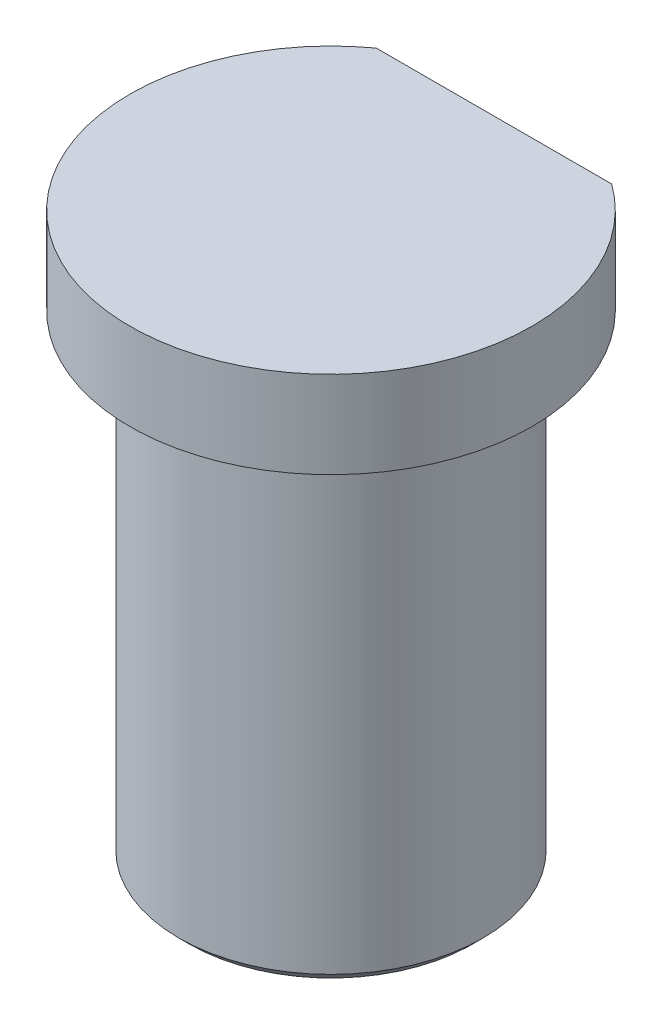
ISO-10303-21;
HEADER;
FILE_DESCRIPTION(('STEP AP214'),'2;1');
FILE_NAME('part.step','',(''),(''),'','','');
FILE_SCHEMA(('AUTOMOTIVE_DESIGN { 1 0 10303 214 1 1 1 1 }'));
ENDSEC;
DATA;
#1=APPLICATION_CONTEXT('core data for automotive mechanical design processes');
#2=APPLICATION_PROTOCOL_DEFINITION('international standard','automotive_design',2000,#1);
#3=PRODUCT_CONTEXT('',#1,'mechanical');
#4=PRODUCT('Part','Part','',(#3));
#5=PRODUCT_RELATED_PRODUCT_CATEGORY('part','',(#4));
#6=PRODUCT_DEFINITION_FORMATION('','',#4);
#7=PRODUCT_DEFINITION_CONTEXT('part definition',#1,'design');
#8=PRODUCT_DEFINITION('design','',#6,#7);
#9=PRODUCT_DEFINITION_SHAPE('','',#8);
#10=(LENGTH_UNIT() NAMED_UNIT(*) SI_UNIT(.MILLI.,.METRE.));
#11=(NAMED_UNIT(*) PLANE_ANGLE_UNIT() SI_UNIT($,.RADIAN.));
#12=(NAMED_UNIT(*) SI_UNIT($,.STERADIAN.) SOLID_ANGLE_UNIT());
#13=UNCERTAINTY_MEASURE_WITH_UNIT(LENGTH_MEASURE(1.E-05),#10,'distance_accuracy_value','');
#14=(GEOMETRIC_REPRESENTATION_CONTEXT(3) GLOBAL_UNCERTAINTY_ASSIGNED_CONTEXT((#13)) GLOBAL_UNIT_ASSIGNED_CONTEXT((#10,
#11,#12)) REPRESENTATION_CONTEXT('',''));
#15=CARTESIAN_POINT('',(0.,0.,0.));
#16=DIRECTION('',(0.,0.,1.));
#17=DIRECTION('',(1.,0.,0.));
#18=AXIS2_PLACEMENT_3D('',#15,#16,#17);
#19=CARTESIAN_POINT('',(0.,-113.958548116,65.));
#20=DIRECTION('',(0.,-1.,0.));
#21=DIRECTION('',(0.,0.,-1.));
#22=AXIS2_PLACEMENT_3D('',#19,#20,#21);
#23=CONICAL_SURFACE('',#22,0.,1.04719755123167);
#24=CARTESIAN_POINT('',(0.,-113.958548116,65.));
#25=VERTEX_POINT('',#24);
#26=VERTEX_LOOP('',#25);
#27=FACE_BOUND('',#26,.T.);
#28=CARTESIAN_POINT('',(0.,-118.,65.));
#29=DIRECTION('',(0.,-1.,0.));
#30=DIRECTION('',(-1.,0.,0.));
#31=AXIS2_PLACEMENT_3D('',#28,#29,#30);
#32=CIRCLE('',#31,7.);
#33=CARTESIAN_POINT('',(-7.,-118.,65.));
#34=VERTEX_POINT('',#33);
#35=EDGE_CURVE('E70',#34,#34,#32,.F.);
#36=ORIENTED_EDGE('',*,*,#35,.F.);
#37=EDGE_LOOP('',(#36));
#38=FACE_BOUND('',#37,.T.);
#39=ADVANCED_FACE('F16',(#27,#38),#23,.F.);
#40=CARTESIAN_POINT('',(0.,-118.,65.));
#41=DIRECTION('',(0.,-1.,0.));
#42=DIRECTION('',(0.,0.,-1.));
#43=AXIS2_PLACEMENT_3D('',#40,#41,#42);
#44=CYLINDRICAL_SURFACE('',#43,7.);
#45=ORIENTED_EDGE('',*,*,#35,.T.);
#46=EDGE_LOOP('',(#45));
#47=FACE_BOUND('',#46,.T.);
#48=CARTESIAN_POINT('',(0.,-158.,65.));
#49=DIRECTION('',(0.,-1.,0.));
#50=DIRECTION('',(0.,0.,-1.));
#51=AXIS2_PLACEMENT_3D('',#48,#49,#50);
#52=CIRCLE('',#51,7.);
#53=CARTESIAN_POINT('',(0.,-158.,58.));
#54=VERTEX_POINT('',#53);
#55=EDGE_CURVE('E20',#54,#54,#52,.F.);
#56=ORIENTED_EDGE('',*,*,#55,.F.);
#57=EDGE_LOOP('',(#56));
#58=FACE_BOUND('',#57,.T.);
#59=ADVANCED_FACE('F66',(#47,#58),#44,.F.);
#60=CARTESIAN_POINT('',(-13.156,-158.,51.844));
#61=DIRECTION('',(0.,-1.,0.));
#62=DIRECTION('',(1.,0.,0.));
#63=AXIS2_PLACEMENT_3D('',#60,#61,#62);
#64=PLANE('',#63);
#65=ORIENTED_EDGE('',*,*,#55,.T.);
#66=EDGE_LOOP('',(#65));
#67=FACE_BOUND('',#66,.T.);
#68=CARTESIAN_POINT('',(0.,-158.,65.));
#69=DIRECTION('',(0.,1.,0.));
#70=DIRECTION('',(0.,0.,1.));
#71=AXIS2_PLACEMENT_3D('',#68,#69,#70);
#72=CIRCLE('',#71,13.);
#73=CARTESIAN_POINT('',(0.,-158.,78.));
#74=VERTEX_POINT('',#73);
#75=EDGE_CURVE('E74',#74,#74,#72,.F.);
#76=ORIENTED_EDGE('',*,*,#75,.T.);
#77=EDGE_LOOP('',(#76));
#78=FACE_BOUND('',#77,.T.);
#79=ADVANCED_FACE('F203',(#67,#78),#64,.T.);
#80=CARTESIAN_POINT('',(0.,-158.,65.));
#81=DIRECTION('',(0.,1.,0.));
#82=DIRECTION('',(0.,0.,1.));
#83=AXIS2_PLACEMENT_3D('',#80,#81,#82);
#84=CONICAL_SURFACE('',#83,13.,0.785398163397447);
#85=ORIENTED_EDGE('',*,*,#75,.F.);
#86=EDGE_LOOP('',(#85));
#87=FACE_BOUND('',#86,.T.);
#88=CARTESIAN_POINT('',(0.,-157.,65.));
#89=DIRECTION('',(0.,-1.,0.));
#90=DIRECTION('',(-1.,0.,0.));
#91=AXIS2_PLACEMENT_3D('',#88,#89,#90);
#92=CIRCLE('',#91,14.);
#93=CARTESIAN_POINT('',(-14.,-157.,65.));
#94=VERTEX_POINT('',#93);
#95=EDGE_CURVE('E77',#94,#94,#92,.T.);
#96=ORIENTED_EDGE('',*,*,#95,.T.);
#97=EDGE_LOOP('',(#96));
#98=FACE_BOUND('',#97,.T.);
#99=ADVANCED_FACE('F199',(#87,#98),#84,.T.);
#100=CARTESIAN_POINT('',(0.,-114.5,65.));
#101=DIRECTION('',(0.,-1.,0.));
#102=DIRECTION('',(0.,0.,-1.));
#103=AXIS2_PLACEMENT_3D('',#100,#101,#102);
#104=CYLINDRICAL_SURFACE('',#103,14.);
#105=ORIENTED_EDGE('',*,*,#95,.F.);
#106=EDGE_LOOP('',(#105));
#107=FACE_BOUND('',#106,.T.);
#108=CARTESIAN_POINT('',(0.,-114.499999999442,65.));
#109=DIRECTION('',(0.,-1.,0.));
#110=DIRECTION('',(0.,0.,-1.));
#111=AXIS2_PLACEMENT_3D('',#108,#109,#110);
#112=CIRCLE('',#111,13.9999999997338);
#113=CARTESIAN_POINT('',(-13.9999999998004,-114.499999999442,65.));
#114=VERTEX_POINT('',#113);
#115=CARTESIAN_POINT('',(13.9999999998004,-114.499999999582,65.0000000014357));
#116=VERTEX_POINT('',#115);
#117=EDGE_CURVE('E120',#114,#116,#112,.T.);
#118=ORIENTED_EDGE('',*,*,#117,.T.);
#119=CARTESIAN_POINT('',(0.,-114.499999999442,65.));
#120=DIRECTION('',(0.,-1.,0.));
#121=DIRECTION('',(0.,0.,-1.));
#122=AXIS2_PLACEMENT_3D('',#119,#120,#121);
#123=CIRCLE('',#122,13.9999999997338);
#124=EDGE_CURVE('E113',#116,#114,#123,.T.);
#125=ORIENTED_EDGE('',*,*,#124,.T.);
#126=EDGE_LOOP('',(#118,#125));
#127=FACE_BOUND('',#126,.T.);
#128=ADVANCED_FACE('F191',(#107,#127),#104,.T.);
#129=CARTESIAN_POINT('',(14.549916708,-114.002497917,65.));
#130=CARTESIAN_POINT('',(14.549916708,-114.002497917,94.099833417));
#131=CARTESIAN_POINT('',(-14.549916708,-114.002497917,94.099833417));
#132=CARTESIAN_POINT('',(-14.549916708,-114.002497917,65.));
#133=CARTESIAN_POINT('',(14.209973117,-113.968389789,65.));
#134=CARTESIAN_POINT('',(14.209973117,-113.968389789,93.419946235));
#135=CARTESIAN_POINT('',(-14.209973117,-113.968389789,93.419946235));
#136=CARTESIAN_POINT('',(-14.209973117,-113.968389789,65.));
#137=CARTESIAN_POINT('',(13.968389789,-114.209973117,65.));
#138=CARTESIAN_POINT('',(13.968389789,-114.209973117,92.936779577));
#139=CARTESIAN_POINT('',(-13.968389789,-114.209973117,92.936779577));
#140=CARTESIAN_POINT('',(-13.968389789,-114.209973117,65.));
#141=CARTESIAN_POINT('',(14.002497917,-114.549916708,65.));
#142=CARTESIAN_POINT('',(14.002497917,-114.549916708,93.004995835));
#143=CARTESIAN_POINT('',(-14.002497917,-114.549916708,93.004995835));
#144=CARTESIAN_POINT('',(-14.002497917,-114.549916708,65.));
#145=(BOUNDED_SURFACE() B_SPLINE_SURFACE(3,3,((#129,#130,#131,#132),(#133,#134,#135,#136),(#137,
#138,#139,#140),(#141,#142,#143,#144)),.UNSPECIFIED.,.F.,.F.,
.F.) B_SPLINE_SURFACE_WITH_KNOTS((4,4),(4,4),(0.,1.),(0.,1.),
.UNSPECIFIED.) GEOMETRIC_REPRESENTATION_ITEM() RATIONAL_B_SPLINE_SURFACE(((1.,0.333333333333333,
0.333333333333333,1.),(0.755320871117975,0.251773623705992,0.251773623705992,0.755320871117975),
(0.755320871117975,0.251773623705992,0.251773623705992,0.755320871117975),(1.,0.333333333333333,
0.333333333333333,1.))) REPRESENTATION_ITEM('') SURFACE());
#146=CARTESIAN_POINT('',(14.549916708,-114.002497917,65.));
#147=CARTESIAN_POINT('',(14.209973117,-113.968389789,65.));
#148=CARTESIAN_POINT('',(13.968389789,-114.209973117,65.));
#149=CARTESIAN_POINT('',(14.002497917,-114.549916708,65.));
#150=(BOUNDED_CURVE() B_SPLINE_CURVE(3,(#146,#147,#148,#149),.UNSPECIFIED.,.F.,
.F.) B_SPLINE_CURVE_WITH_KNOTS((4,4),(0.,1.),
.UNSPECIFIED.) CURVE() GEOMETRIC_REPRESENTATION_ITEM() RATIONAL_B_SPLINE_CURVE((1.,
0.755320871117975,0.755320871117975,1.)) REPRESENTATION_ITEM(''));
#151=CARTESIAN_POINT('',(14.4999999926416,-113.99999999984,64.99999999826));
#152=VERTEX_POINT('',#151);
#153=EDGE_CURVE('E52',#116,#152,#150,.F.);
#154=CARTESIAN_POINT('',(14.4999999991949,-113.999999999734,65.));
#155=CARTESIAN_POINT('',(14.4999999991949,-113.999999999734,93.9999999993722));
#156=CARTESIAN_POINT('',(-14.4999999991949,-113.999999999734,93.9999999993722));
#157=CARTESIAN_POINT('',(-14.4999999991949,-113.999999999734,65.));
#158=(BOUNDED_CURVE() B_SPLINE_CURVE(3,(#154,#155,#156,#157),.UNSPECIFIED.,.F.,
.F.) B_SPLINE_CURVE_WITH_KNOTS((4,4),(0.,1.),
.UNSPECIFIED.) CURVE() GEOMETRIC_REPRESENTATION_ITEM() RATIONAL_B_SPLINE_CURVE((0.956578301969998,
0.318859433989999,0.318859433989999,0.956578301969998)) REPRESENTATION_ITEM(''));
#159=CARTESIAN_POINT('',(-14.4999999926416,-113.99999999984,64.99999999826));
#160=VERTEX_POINT('',#159);
#161=EDGE_CURVE('E83',#160,#152,#158,.F.);
#162=CARTESIAN_POINT('',(-14.549916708,-114.002497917,65.));
#163=CARTESIAN_POINT('',(-14.209973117,-113.968389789,65.));
#164=CARTESIAN_POINT('',(-13.968389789,-114.209973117,65.));
#165=CARTESIAN_POINT('',(-14.002497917,-114.549916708,65.));
#166=(BOUNDED_CURVE() B_SPLINE_CURVE(3,(#162,#163,#164,#165),.UNSPECIFIED.,.F.,
.F.) B_SPLINE_CURVE_WITH_KNOTS((4,4),(0.,1.),
.UNSPECIFIED.) CURVE() GEOMETRIC_REPRESENTATION_ITEM() RATIONAL_B_SPLINE_CURVE((1.,
0.755320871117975,0.755320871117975,1.)) REPRESENTATION_ITEM(''));
#167=EDGE_CURVE('E116',#160,#114,#166,.T.);
#168=ORIENTED_EDGE('',*,*,#153,.T.);
#169=ORIENTED_EDGE('',*,*,#161,.F.);
#170=ORIENTED_EDGE('',*,*,#167,.T.);
#171=ORIENTED_EDGE('',*,*,#124,.F.);
#172=EDGE_LOOP('',(#168,#169,#170,#171));
#173=FACE_BOUND('',#172,.T.);
#174=ADVANCED_FACE('F156',(#173),#145,.F.);
#175=CARTESIAN_POINT('',(-14.549916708,-114.002497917,65.));
#176=CARTESIAN_POINT('',(-14.549916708,-114.002497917,35.900166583));
#177=CARTESIAN_POINT('',(14.549916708,-114.002497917,35.900166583));
#178=CARTESIAN_POINT('',(14.549916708,-114.002497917,65.));
#179=CARTESIAN_POINT('',(-14.209973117,-113.968389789,65.));
#180=CARTESIAN_POINT('',(-14.209973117,-113.968389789,36.580053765));
#181=CARTESIAN_POINT('',(14.209973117,-113.968389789,36.580053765));
#182=CARTESIAN_POINT('',(14.209973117,-113.968389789,65.));
#183=CARTESIAN_POINT('',(-13.968389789,-114.209973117,65.));
#184=CARTESIAN_POINT('',(-13.968389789,-114.209973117,37.063220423));
#185=CARTESIAN_POINT('',(13.968389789,-114.209973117,37.063220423));
#186=CARTESIAN_POINT('',(13.968389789,-114.209973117,65.));
#187=CARTESIAN_POINT('',(-14.002497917,-114.549916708,65.));
#188=CARTESIAN_POINT('',(-14.002497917,-114.549916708,36.995004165));
#189=CARTESIAN_POINT('',(14.002497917,-114.549916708,36.995004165));
#190=CARTESIAN_POINT('',(14.002497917,-114.549916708,65.));
#191=(BOUNDED_SURFACE() B_SPLINE_SURFACE(3,3,((#175,#176,#177,#178),(#179,#180,#181,#182),(#183,
#184,#185,#186),(#187,#188,#189,#190)),.UNSPECIFIED.,.F.,.F.,
.F.) B_SPLINE_SURFACE_WITH_KNOTS((4,4),(4,4),(0.,1.),(0.,1.),
.UNSPECIFIED.) GEOMETRIC_REPRESENTATION_ITEM() RATIONAL_B_SPLINE_SURFACE(((1.,0.333333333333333,
0.333333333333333,1.),(0.755320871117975,0.251773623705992,0.251773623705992,0.755320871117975),
(0.755320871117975,0.251773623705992,0.251773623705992,0.755320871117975),(1.,0.333333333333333,
0.333333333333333,1.))) REPRESENTATION_ITEM('') SURFACE());
#192=CARTESIAN_POINT('',(-14.4999999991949,-113.999999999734,65.));
#193=CARTESIAN_POINT('',(-14.4999999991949,-113.999999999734,36.0000000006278));
#194=CARTESIAN_POINT('',(14.4999999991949,-113.999999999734,36.0000000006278));
#195=CARTESIAN_POINT('',(14.4999999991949,-113.999999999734,65.));
#196=(BOUNDED_CURVE() B_SPLINE_CURVE(3,(#192,#193,#194,#195),.UNSPECIFIED.,.F.,
.F.) B_SPLINE_CURVE_WITH_KNOTS((4,4),(0.,1.),
.UNSPECIFIED.) CURVE() GEOMETRIC_REPRESENTATION_ITEM() RATIONAL_B_SPLINE_CURVE((0.956578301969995,
0.318859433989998,0.318859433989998,0.956578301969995)) REPRESENTATION_ITEM(''));
#197=EDGE_CURVE('E157',#152,#160,#196,.F.);
#198=ORIENTED_EDGE('',*,*,#117,.F.);
#199=ORIENTED_EDGE('',*,*,#167,.F.);
#200=ORIENTED_EDGE('',*,*,#197,.F.);
#201=ORIENTED_EDGE('',*,*,#153,.F.);
#202=EDGE_LOOP('',(#198,#199,#200,#201));
#203=FACE_BOUND('',#202,.T.);
#204=ADVANCED_FACE('F159',(#203),#191,.F.);
#205=CARTESIAN_POINT('',(-10.828203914,-114.,50.));
#206=DIRECTION('',(0.,0.,-1.));
#207=DIRECTION('',(0.,1.,0.));
#208=AXIS2_PLACEMENT_3D('',#205,#206,#207);
#209=PLANE('',#208);
#210=DIRECTION('',(-1.,0.,0.));
#211=VECTOR('',#210,1.);
#212=CARTESIAN_POINT('',(0.,-106.,50.));
#213=LINE('',#212,#211);
#214=CARTESIAN_POINT('',(10.8282039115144,-106.,49.9999999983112));
#215=VERTEX_POINT('',#214);
#216=CARTESIAN_POINT('',(-10.8282039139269,-106.,50.));
#217=VERTEX_POINT('',#216);
#218=EDGE_CURVE('E161',#215,#217,#213,.T.);
#219=ORIENTED_EDGE('',*,*,#218,.F.);
#220=DIRECTION('',(0.,1.,0.));
#221=VECTOR('',#220,1.);
#222=CARTESIAN_POINT('',(10.828203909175,-110.,49.9999999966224));
#223=LINE('',#222,#221);
#224=CARTESIAN_POINT('',(10.8282039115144,-114.,49.9999999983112));
#225=VERTEX_POINT('',#224);
#226=EDGE_CURVE('E35',#215,#225,#223,.F.);
#227=ORIENTED_EDGE('',*,*,#226,.T.);
#228=DIRECTION('',(1.,0.,0.));
#229=VECTOR('',#228,1.);
#230=CARTESIAN_POINT('',(0.,-114.,50.));
#231=LINE('',#230,#229);
#232=CARTESIAN_POINT('',(-10.8282039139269,-114.,50.));
#233=VERTEX_POINT('',#232);
#234=EDGE_CURVE('E134',#233,#225,#231,.T.);
#235=ORIENTED_EDGE('',*,*,#234,.F.);
#236=DIRECTION('',(0.,1.,0.));
#237=VECTOR('',#236,1.);
#238=CARTESIAN_POINT('',(-10.828203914,-110.,50.));
#239=LINE('',#238,#237);
#240=EDGE_CURVE('E132',#233,#217,#239,.T.);
#241=ORIENTED_EDGE('',*,*,#240,.T.);
#242=EDGE_LOOP('',(#219,#227,#235,#241));
#243=FACE_BOUND('',#242,.T.);
#244=ADVANCED_FACE('F97',(#243),#209,.T.);
#245=CARTESIAN_POINT('',(18.722,-114.,83.701));
#246=DIRECTION('',(0.,-1.,0.));
#247=DIRECTION('',(-1.,0.,0.));
#248=AXIS2_PLACEMENT_3D('',#245,#246,#247);
#249=PLANE('',#248);
#250=ORIENTED_EDGE('',*,*,#161,.T.);
#251=ORIENTED_EDGE('',*,*,#197,.T.);
#252=EDGE_LOOP('',(#250,#251));
#253=FACE_BOUND('',#252,.T.);
#254=CARTESIAN_POINT('',(0.,-114.,65.));
#255=DIRECTION('',(0.,-1.,0.));
#256=DIRECTION('',(0.,0.,-1.));
#257=AXIS2_PLACEMENT_3D('',#254,#255,#256);
#258=CIRCLE('',#257,18.5);
#259=EDGE_CURVE('E26',#225,#233,#258,.T.);
#260=ORIENTED_EDGE('',*,*,#259,.T.);
#261=ORIENTED_EDGE('',*,*,#234,.T.);
#262=EDGE_LOOP('',(#260,#261));
#263=FACE_BOUND('',#262,.T.);
#264=ADVANCED_FACE('F88',(#253,#263),#249,.T.);
#265=CARTESIAN_POINT('',(-18.722,-106.,83.701));
#266=DIRECTION('',(0.,1.,0.));
#267=DIRECTION('',(1.,0.,0.));
#268=AXIS2_PLACEMENT_3D('',#265,#266,#267);
#269=PLANE('',#268);
#270=ORIENTED_EDGE('',*,*,#218,.T.);
#271=CARTESIAN_POINT('',(0.,-106.,65.));
#272=DIRECTION('',(0.,-1.,0.));
#273=DIRECTION('',(0.,0.,-1.));
#274=AXIS2_PLACEMENT_3D('',#271,#272,#273);
#275=CIRCLE('',#274,18.5);
#276=EDGE_CURVE('E11',#217,#215,#275,.F.);
#277=ORIENTED_EDGE('',*,*,#276,.T.);
#278=EDGE_LOOP('',(#270,#277));
#279=FACE_BOUND('',#278,.T.);
#280=ADVANCED_FACE('F18',(#279),#269,.T.);
#281=CARTESIAN_POINT('',(0.,-106.,65.));
#282=DIRECTION('',(0.,-1.,0.));
#283=DIRECTION('',(0.,0.,-1.));
#284=AXIS2_PLACEMENT_3D('',#281,#282,#283);
#285=CYLINDRICAL_SURFACE('',#284,18.5);
#286=ORIENTED_EDGE('',*,*,#276,.F.);
#287=ORIENTED_EDGE('',*,*,#240,.F.);
#288=ORIENTED_EDGE('',*,*,#259,.F.);
#289=ORIENTED_EDGE('',*,*,#226,.F.);
#290=EDGE_LOOP('',(#286,#287,#288,#289));
#291=FACE_BOUND('',#290,.T.);
#292=ADVANCED_FACE('F168',(#291),#285,.T.);
#293=CLOSED_SHELL('',(#39,#59,#79,#99,#128,#174,#204,#244,#264,#280,#292));
#294=MANIFOLD_SOLID_BREP('B1',#293);
#295=ADVANCED_BREP_SHAPE_REPRESENTATION('',(#18,#294),#14);
#296=SHAPE_DEFINITION_REPRESENTATION(#9,#295);
ENDSEC;
END-ISO-10303-21;
